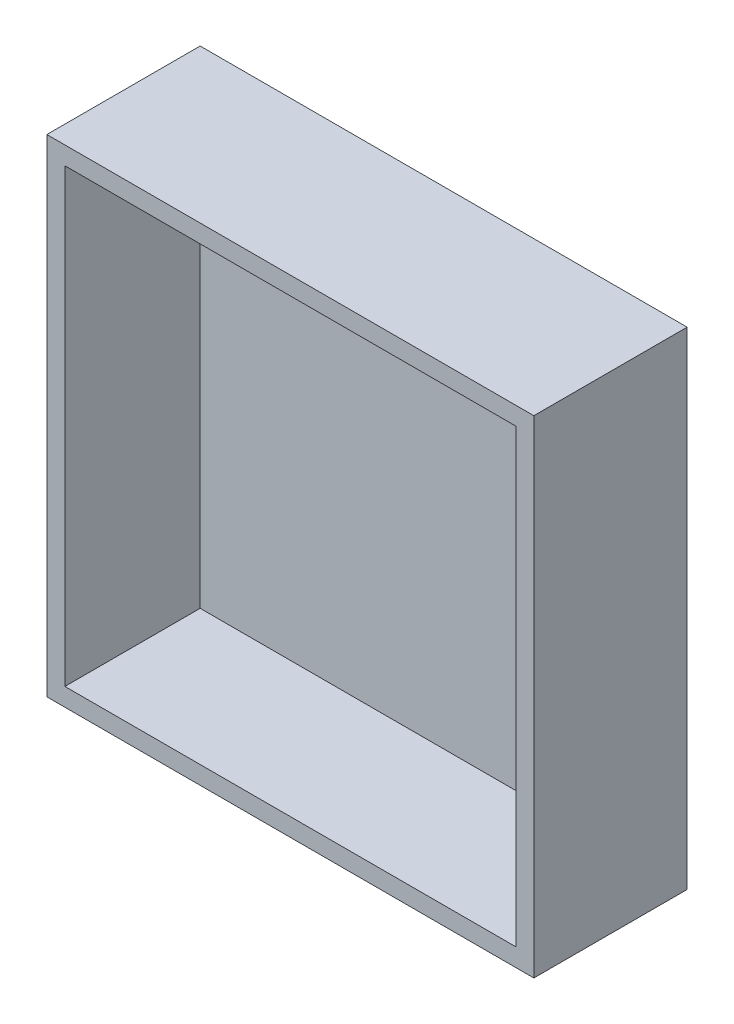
from build123d import *

# Parameters (mm, degrees)
SZKIC1_W                    = 50
SZKIC1_H                    = 50
DODANIE_WYCI_GNI_CIE1_DEPTH = 15
SKORUPA1_T                  = 2


with BuildPart() as part:
    # Szkic1 → Dodanie-wyci_gni_cie1 (new body)
    with BuildSketch(Plane.XY):
        Rectangle(SZKIC1_W, SZKIC1_H)
    extrude(amount=DODANIE_WYCI_GNI_CIE1_DEPTH)

    # Skorupa1
    skorupa1_openings = [part.faces().sort_by_distance(p)[0] for p in [
        (0, 0, 15),
    ]]
    offset(amount=SKORUPA1_T, openings=skorupa1_openings, kind=Kind.INTERSECTION)


solid = part.part
